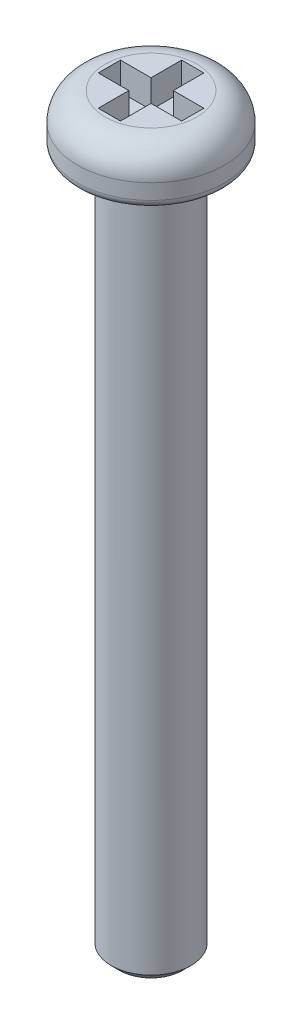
ISO-10303-21;
HEADER;
FILE_DESCRIPTION(('STEP AP214'),'2;1');
FILE_NAME('part.step','',(''),(''),'','','');
FILE_SCHEMA(('AUTOMOTIVE_DESIGN { 1 0 10303 214 1 1 1 1 }'));
ENDSEC;
DATA;
#1=APPLICATION_CONTEXT('core data for automotive mechanical design processes');
#2=APPLICATION_PROTOCOL_DEFINITION('international standard','automotive_design',2000,#1);
#3=PRODUCT_CONTEXT('',#1,'mechanical');
#4=PRODUCT('Part','Part','',(#3));
#5=PRODUCT_RELATED_PRODUCT_CATEGORY('part','',(#4));
#6=PRODUCT_DEFINITION_FORMATION('','',#4);
#7=PRODUCT_DEFINITION_CONTEXT('part definition',#1,'design');
#8=PRODUCT_DEFINITION('design','',#6,#7);
#9=PRODUCT_DEFINITION_SHAPE('','',#8);
#10=(LENGTH_UNIT() NAMED_UNIT(*) SI_UNIT(.MILLI.,.METRE.));
#11=(NAMED_UNIT(*) PLANE_ANGLE_UNIT() SI_UNIT($,.RADIAN.));
#12=(NAMED_UNIT(*) SI_UNIT($,.STERADIAN.) SOLID_ANGLE_UNIT());
#13=UNCERTAINTY_MEASURE_WITH_UNIT(LENGTH_MEASURE(1.E-05),#10,'distance_accuracy_value','');
#14=(GEOMETRIC_REPRESENTATION_CONTEXT(3) GLOBAL_UNCERTAINTY_ASSIGNED_CONTEXT((#13)) GLOBAL_UNIT_ASSIGNED_CONTEXT((#10,
#11,#12)) REPRESENTATION_CONTEXT('',''));
#15=CARTESIAN_POINT('',(0.,0.,0.));
#16=DIRECTION('',(0.,0.,1.));
#17=DIRECTION('',(1.,0.,0.));
#18=AXIS2_PLACEMENT_3D('',#15,#16,#17);
#19=CARTESIAN_POINT('',(0.,25.85,0.));
#20=DIRECTION('',(0.,1.,0.));
#21=DIRECTION('',(0.,0.,1.));
#22=AXIS2_PLACEMENT_3D('',#19,#20,#21);
#23=PLANE('',#22);
#24=DIRECTION('',(0.,0.,1.));
#25=VECTOR('',#24,1.);
#26=CARTESIAN_POINT('',(-0.4,25.85,1.5));
#27=LINE('',#26,#25);
#28=CARTESIAN_POINT('',(-0.4,25.85,0.399999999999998));
#29=VERTEX_POINT('',#28);
#30=CARTESIAN_POINT('',(-0.4,25.85,1.5));
#31=VERTEX_POINT('',#30);
#32=EDGE_CURVE('E240',#29,#31,#27,.T.);
#33=ORIENTED_EDGE('',*,*,#32,.T.);
#34=DIRECTION('',(1.,0.,0.));
#35=VECTOR('',#34,1.);
#36=CARTESIAN_POINT('',(0.4,25.85,1.5));
#37=LINE('',#36,#35);
#38=CARTESIAN_POINT('',(0.4,25.85,1.5));
#39=VERTEX_POINT('',#38);
#40=EDGE_CURVE('E246',#31,#39,#37,.T.);
#41=ORIENTED_EDGE('',*,*,#40,.T.);
#42=DIRECTION('',(0.,0.,-1.));
#43=VECTOR('',#42,1.);
#44=CARTESIAN_POINT('',(0.4,25.85,1.5));
#45=LINE('',#44,#43);
#46=CARTESIAN_POINT('',(0.4,25.85,0.400000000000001));
#47=VERTEX_POINT('',#46);
#48=EDGE_CURVE('E250',#39,#47,#45,.T.);
#49=ORIENTED_EDGE('',*,*,#48,.T.);
#50=DIRECTION('',(1.,0.,0.));
#51=VECTOR('',#50,1.);
#52=CARTESIAN_POINT('',(-1.5,25.85,0.399999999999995));
#53=LINE('',#52,#51);
#54=CARTESIAN_POINT('',(1.5,25.85,0.400000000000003));
#55=VERTEX_POINT('',#54);
#56=EDGE_CURVE('E114',#47,#55,#53,.T.);
#57=ORIENTED_EDGE('',*,*,#56,.T.);
#58=DIRECTION('',(0.,0.,-1.));
#59=VECTOR('',#58,1.);
#60=CARTESIAN_POINT('',(1.5,25.85,0.400000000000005));
#61=LINE('',#60,#59);
#62=CARTESIAN_POINT('',(1.5,25.85,-0.399999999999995));
#63=VERTEX_POINT('',#62);
#64=EDGE_CURVE('E116',#55,#63,#61,.T.);
#65=ORIENTED_EDGE('',*,*,#64,.T.);
#66=DIRECTION('',(-1.,0.,0.));
#67=VECTOR('',#66,1.);
#68=CARTESIAN_POINT('',(-1.5,25.85,-0.400000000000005));
#69=LINE('',#68,#67);
#70=CARTESIAN_POINT('',(0.4,25.85,-0.399999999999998));
#71=VERTEX_POINT('',#70);
#72=EDGE_CURVE('E120',#63,#71,#69,.T.);
#73=ORIENTED_EDGE('',*,*,#72,.T.);
#74=DIRECTION('',(0.,0.,-1.));
#75=VECTOR('',#74,1.);
#76=CARTESIAN_POINT('',(0.4,25.85,1.5));
#77=LINE('',#76,#75);
#78=CARTESIAN_POINT('',(0.4,25.85,-1.5));
#79=VERTEX_POINT('',#78);
#80=EDGE_CURVE('E208',#71,#79,#77,.T.);
#81=ORIENTED_EDGE('',*,*,#80,.T.);
#82=DIRECTION('',(-1.,0.,0.));
#83=VECTOR('',#82,1.);
#84=CARTESIAN_POINT('',(0.4,25.85,-1.5));
#85=LINE('',#84,#83);
#86=CARTESIAN_POINT('',(-0.4,25.85,-1.5));
#87=VERTEX_POINT('',#86);
#88=EDGE_CURVE('E221',#79,#87,#85,.T.);
#89=ORIENTED_EDGE('',*,*,#88,.T.);
#90=DIRECTION('',(0.,0.,1.));
#91=VECTOR('',#90,1.);
#92=CARTESIAN_POINT('',(-0.4,25.85,1.5));
#93=LINE('',#92,#91);
#94=CARTESIAN_POINT('',(-0.4,25.85,-0.400000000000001));
#95=VERTEX_POINT('',#94);
#96=EDGE_CURVE('E225',#87,#95,#93,.T.);
#97=ORIENTED_EDGE('',*,*,#96,.T.);
#98=DIRECTION('',(-1.,0.,0.));
#99=VECTOR('',#98,1.);
#100=CARTESIAN_POINT('',(-1.5,25.85,-0.400000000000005));
#101=LINE('',#100,#99);
#102=CARTESIAN_POINT('',(-1.5,25.85,-0.400000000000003));
#103=VERTEX_POINT('',#102);
#104=EDGE_CURVE('E229',#95,#103,#101,.T.);
#105=ORIENTED_EDGE('',*,*,#104,.T.);
#106=DIRECTION('',(0.,0.,1.));
#107=VECTOR('',#106,1.);
#108=CARTESIAN_POINT('',(-1.5,25.85,0.399999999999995));
#109=LINE('',#108,#107);
#110=CARTESIAN_POINT('',(-1.5,25.85,0.399999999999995));
#111=VERTEX_POINT('',#110);
#112=EDGE_CURVE('E233',#103,#111,#109,.T.);
#113=ORIENTED_EDGE('',*,*,#112,.T.);
#114=DIRECTION('',(1.,0.,0.));
#115=VECTOR('',#114,1.);
#116=CARTESIAN_POINT('',(-1.5,25.85,0.399999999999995));
#117=LINE('',#116,#115);
#118=EDGE_CURVE('E235',#111,#29,#117,.T.);
#119=ORIENTED_EDGE('',*,*,#118,.T.);
#120=EDGE_LOOP('',(#33,#41,#49,#57,#65,#73,#81,#89,#97,#105,#113,#119));
#121=FACE_BOUND('',#120,.T.);
#122=ADVANCED_FACE('F14',(#121),#23,.T.);
#123=CARTESIAN_POINT('',(-1.5,25.85,-0.400000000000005));
#124=DIRECTION('',(0.,0.,-1.));
#125=DIRECTION('',(-1.,0.,0.));
#126=AXIS2_PLACEMENT_3D('',#123,#124,#125);
#127=PLANE('',#126);
#128=DIRECTION('',(0.,1.,0.));
#129=VECTOR('',#128,1.);
#130=CARTESIAN_POINT('',(1.5,25.85,-0.399999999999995));
#131=LINE('',#130,#129);
#132=CARTESIAN_POINT('',(1.5,26.85,-0.399999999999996));
#133=VERTEX_POINT('',#132);
#134=EDGE_CURVE('E125',#63,#133,#131,.T.);
#135=ORIENTED_EDGE('',*,*,#134,.T.);
#136=DIRECTION('',(1.,0.,0.));
#137=VECTOR('',#136,1.);
#138=CARTESIAN_POINT('',(0.,26.85,-0.399999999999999));
#139=LINE('',#138,#137);
#140=CARTESIAN_POINT('',(0.4,26.85,-0.399999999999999));
#141=VERTEX_POINT('',#140);
#142=EDGE_CURVE('E215',#141,#133,#139,.T.);
#143=ORIENTED_EDGE('',*,*,#142,.F.);
#144=DIRECTION('',(0.,1.,0.));
#145=VECTOR('',#144,1.);
#146=CARTESIAN_POINT('',(0.4,25.85,-0.399999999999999));
#147=LINE('',#146,#145);
#148=EDGE_CURVE('E131',#141,#71,#147,.F.);
#149=ORIENTED_EDGE('',*,*,#148,.T.);
#150=ORIENTED_EDGE('',*,*,#72,.F.);
#151=EDGE_LOOP('',(#135,#143,#149,#150));
#152=FACE_BOUND('',#151,.T.);
#153=ADVANCED_FACE('F128',(#152),#127,.F.);
#154=CARTESIAN_POINT('',(1.5,25.85,0.400000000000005));
#155=DIRECTION('',(1.,0.,0.));
#156=DIRECTION('',(0.,0.,-1.));
#157=AXIS2_PLACEMENT_3D('',#154,#155,#156);
#158=PLANE('',#157);
#159=ORIENTED_EDGE('',*,*,#134,.F.);
#160=ORIENTED_EDGE('',*,*,#64,.F.);
#161=DIRECTION('',(0.,1.,0.));
#162=VECTOR('',#161,1.);
#163=CARTESIAN_POINT('',(1.5,25.85,0.400000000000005));
#164=LINE('',#163,#162);
#165=CARTESIAN_POINT('',(1.5,26.85,0.400000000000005));
#166=VERTEX_POINT('',#165);
#167=EDGE_CURVE('E139',#55,#166,#164,.T.);
#168=ORIENTED_EDGE('',*,*,#167,.T.);
#169=DIRECTION('',(0.,0.,1.));
#170=VECTOR('',#169,1.);
#171=CARTESIAN_POINT('',(1.5,26.85,0.));
#172=LINE('',#171,#170);
#173=EDGE_CURVE('E136',#133,#166,#172,.T.);
#174=ORIENTED_EDGE('',*,*,#173,.F.);
#175=EDGE_LOOP('',(#159,#160,#168,#174));
#176=FACE_BOUND('',#175,.T.);
#177=ADVANCED_FACE('F134',(#176),#158,.F.);
#178=CARTESIAN_POINT('',(-1.5,25.85,0.399999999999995));
#179=DIRECTION('',(0.,0.,1.));
#180=DIRECTION('',(1.,0.,0.));
#181=AXIS2_PLACEMENT_3D('',#178,#179,#180);
#182=PLANE('',#181);
#183=ORIENTED_EDGE('',*,*,#167,.F.);
#184=ORIENTED_EDGE('',*,*,#56,.F.);
#185=DIRECTION('',(0.,1.,0.));
#186=VECTOR('',#185,1.);
#187=CARTESIAN_POINT('',(0.4,25.85,0.400000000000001));
#188=LINE('',#187,#186);
#189=CARTESIAN_POINT('',(0.4,26.85,0.400000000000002));
#190=VERTEX_POINT('',#189);
#191=EDGE_CURVE('E248',#47,#190,#188,.T.);
#192=ORIENTED_EDGE('',*,*,#191,.T.);
#193=DIRECTION('',(1.,0.,0.));
#194=VECTOR('',#193,1.);
#195=CARTESIAN_POINT('',(0.,26.85,0.400000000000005));
#196=LINE('',#195,#194);
#197=EDGE_CURVE('E254',#166,#190,#196,.F.);
#198=ORIENTED_EDGE('',*,*,#197,.F.);
#199=EDGE_LOOP('',(#183,#184,#192,#198));
#200=FACE_BOUND('',#199,.T.);
#201=ADVANCED_FACE('F255',(#200),#182,.F.);
#202=CARTESIAN_POINT('',(0.4,25.85,1.5));
#203=DIRECTION('',(1.,0.,0.));
#204=DIRECTION('',(0.,0.,-1.));
#205=AXIS2_PLACEMENT_3D('',#202,#203,#204);
#206=PLANE('',#205);
#207=ORIENTED_EDGE('',*,*,#191,.F.);
#208=ORIENTED_EDGE('',*,*,#48,.F.);
#209=DIRECTION('',(0.,1.,0.));
#210=VECTOR('',#209,1.);
#211=CARTESIAN_POINT('',(0.4,25.85,1.5));
#212=LINE('',#211,#210);
#213=CARTESIAN_POINT('',(0.4,26.85,1.5));
#214=VERTEX_POINT('',#213);
#215=EDGE_CURVE('E244',#39,#214,#212,.T.);
#216=ORIENTED_EDGE('',*,*,#215,.T.);
#217=DIRECTION('',(0.,0.,1.));
#218=VECTOR('',#217,1.);
#219=CARTESIAN_POINT('',(0.4,26.85,0.));
#220=LINE('',#219,#218);
#221=EDGE_CURVE('E260',#190,#214,#220,.T.);
#222=ORIENTED_EDGE('',*,*,#221,.F.);
#223=EDGE_LOOP('',(#207,#208,#216,#222));
#224=FACE_BOUND('',#223,.T.);
#225=ADVANCED_FACE('F449',(#224),#206,.F.);
#226=CARTESIAN_POINT('',(0.4,25.85,1.5));
#227=DIRECTION('',(0.,0.,1.));
#228=DIRECTION('',(1.,0.,0.));
#229=AXIS2_PLACEMENT_3D('',#226,#227,#228);
#230=PLANE('',#229);
#231=ORIENTED_EDGE('',*,*,#215,.F.);
#232=ORIENTED_EDGE('',*,*,#40,.F.);
#233=DIRECTION('',(0.,1.,0.));
#234=VECTOR('',#233,1.);
#235=CARTESIAN_POINT('',(-0.4,25.85,1.5));
#236=LINE('',#235,#234);
#237=CARTESIAN_POINT('',(-0.4,26.85,1.5));
#238=VERTEX_POINT('',#237);
#239=EDGE_CURVE('E242',#31,#238,#236,.T.);
#240=ORIENTED_EDGE('',*,*,#239,.T.);
#241=DIRECTION('',(1.,0.,0.));
#242=VECTOR('',#241,1.);
#243=CARTESIAN_POINT('',(0.,26.85,1.5));
#244=LINE('',#243,#242);
#245=EDGE_CURVE('E267',#214,#238,#244,.F.);
#246=ORIENTED_EDGE('',*,*,#245,.F.);
#247=EDGE_LOOP('',(#231,#232,#240,#246));
#248=FACE_BOUND('',#247,.T.);
#249=ADVANCED_FACE('F439',(#248),#230,.F.);
#250=CARTESIAN_POINT('',(-0.4,25.85,1.5));
#251=DIRECTION('',(-1.,0.,0.));
#252=DIRECTION('',(0.,0.,1.));
#253=AXIS2_PLACEMENT_3D('',#250,#251,#252);
#254=PLANE('',#253);
#255=DIRECTION('',(0.,1.,0.));
#256=VECTOR('',#255,1.);
#257=CARTESIAN_POINT('',(-0.4,25.85,0.399999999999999));
#258=LINE('',#257,#256);
#259=CARTESIAN_POINT('',(-0.4,26.85,0.399999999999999));
#260=VERTEX_POINT('',#259);
#261=EDGE_CURVE('E238',#29,#260,#258,.T.);
#262=ORIENTED_EDGE('',*,*,#261,.T.);
#263=DIRECTION('',(0.,0.,1.));
#264=VECTOR('',#263,1.);
#265=CARTESIAN_POINT('',(-0.4,26.85,0.));
#266=LINE('',#265,#264);
#267=EDGE_CURVE('E270',#238,#260,#266,.F.);
#268=ORIENTED_EDGE('',*,*,#267,.F.);
#269=ORIENTED_EDGE('',*,*,#239,.F.);
#270=ORIENTED_EDGE('',*,*,#32,.F.);
#271=EDGE_LOOP('',(#262,#268,#269,#270));
#272=FACE_BOUND('',#271,.T.);
#273=ADVANCED_FACE('F429',(#272),#254,.F.);
#274=CARTESIAN_POINT('',(-1.5,25.85,0.399999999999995));
#275=DIRECTION('',(0.,0.,1.));
#276=DIRECTION('',(1.,0.,0.));
#277=AXIS2_PLACEMENT_3D('',#274,#275,#276);
#278=PLANE('',#277);
#279=DIRECTION('',(0.,1.,0.));
#280=VECTOR('',#279,1.);
#281=CARTESIAN_POINT('',(-1.5,25.85,0.399999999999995));
#282=LINE('',#281,#280);
#283=CARTESIAN_POINT('',(-1.5,26.85,0.399999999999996));
#284=VERTEX_POINT('',#283);
#285=EDGE_CURVE('E231',#111,#284,#282,.T.);
#286=ORIENTED_EDGE('',*,*,#285,.T.);
#287=DIRECTION('',(1.,0.,0.));
#288=VECTOR('',#287,1.);
#289=CARTESIAN_POINT('',(0.,26.85,0.399999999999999));
#290=LINE('',#289,#288);
#291=EDGE_CURVE('E273',#260,#284,#290,.F.);
#292=ORIENTED_EDGE('',*,*,#291,.F.);
#293=ORIENTED_EDGE('',*,*,#261,.F.);
#294=ORIENTED_EDGE('',*,*,#118,.F.);
#295=EDGE_LOOP('',(#286,#292,#293,#294));
#296=FACE_BOUND('',#295,.T.);
#297=ADVANCED_FACE('F419',(#296),#278,.F.);
#298=CARTESIAN_POINT('',(-1.5,25.85,0.399999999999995));
#299=DIRECTION('',(-1.,0.,0.));
#300=DIRECTION('',(0.,0.,1.));
#301=AXIS2_PLACEMENT_3D('',#298,#299,#300);
#302=PLANE('',#301);
#303=ORIENTED_EDGE('',*,*,#285,.F.);
#304=ORIENTED_EDGE('',*,*,#112,.F.);
#305=DIRECTION('',(0.,1.,0.));
#306=VECTOR('',#305,1.);
#307=CARTESIAN_POINT('',(-1.5,25.85,-0.400000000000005));
#308=LINE('',#307,#306);
#309=CARTESIAN_POINT('',(-1.5,26.85,-0.400000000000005));
#310=VERTEX_POINT('',#309);
#311=EDGE_CURVE('E227',#103,#310,#308,.T.);
#312=ORIENTED_EDGE('',*,*,#311,.T.);
#313=DIRECTION('',(0.,0.,1.));
#314=VECTOR('',#313,1.);
#315=CARTESIAN_POINT('',(-1.5,26.85,0.));
#316=LINE('',#315,#314);
#317=EDGE_CURVE('E276',#284,#310,#316,.F.);
#318=ORIENTED_EDGE('',*,*,#317,.F.);
#319=EDGE_LOOP('',(#303,#304,#312,#318));
#320=FACE_BOUND('',#319,.T.);
#321=ADVANCED_FACE('F409',(#320),#302,.F.);
#322=CARTESIAN_POINT('',(-1.5,25.85,-0.400000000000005));
#323=DIRECTION('',(0.,0.,-1.));
#324=DIRECTION('',(-1.,0.,0.));
#325=AXIS2_PLACEMENT_3D('',#322,#323,#324);
#326=PLANE('',#325);
#327=ORIENTED_EDGE('',*,*,#311,.F.);
#328=ORIENTED_EDGE('',*,*,#104,.F.);
#329=DIRECTION('',(0.,1.,0.));
#330=VECTOR('',#329,1.);
#331=CARTESIAN_POINT('',(-0.4,25.85,-0.400000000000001));
#332=LINE('',#331,#330);
#333=CARTESIAN_POINT('',(-0.4,26.85,-0.400000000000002));
#334=VERTEX_POINT('',#333);
#335=EDGE_CURVE('E223',#95,#334,#332,.T.);
#336=ORIENTED_EDGE('',*,*,#335,.T.);
#337=DIRECTION('',(1.,0.,0.));
#338=VECTOR('',#337,1.);
#339=CARTESIAN_POINT('',(0.,26.85,-0.400000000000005));
#340=LINE('',#339,#338);
#341=EDGE_CURVE('E279',#310,#334,#340,.T.);
#342=ORIENTED_EDGE('',*,*,#341,.F.);
#343=EDGE_LOOP('',(#327,#328,#336,#342));
#344=FACE_BOUND('',#343,.T.);
#345=ADVANCED_FACE('F399',(#344),#326,.F.);
#346=CARTESIAN_POINT('',(-0.4,25.85,1.5));
#347=DIRECTION('',(-1.,0.,0.));
#348=DIRECTION('',(0.,0.,1.));
#349=AXIS2_PLACEMENT_3D('',#346,#347,#348);
#350=PLANE('',#349);
#351=ORIENTED_EDGE('',*,*,#335,.F.);
#352=ORIENTED_EDGE('',*,*,#96,.F.);
#353=DIRECTION('',(0.,1.,0.));
#354=VECTOR('',#353,1.);
#355=CARTESIAN_POINT('',(-0.4,25.85,-1.5));
#356=LINE('',#355,#354);
#357=CARTESIAN_POINT('',(-0.4,26.85,-1.5));
#358=VERTEX_POINT('',#357);
#359=EDGE_CURVE('E219',#87,#358,#356,.T.);
#360=ORIENTED_EDGE('',*,*,#359,.T.);
#361=DIRECTION('',(0.,0.,1.));
#362=VECTOR('',#361,1.);
#363=CARTESIAN_POINT('',(-0.4,26.85,0.));
#364=LINE('',#363,#362);
#365=EDGE_CURVE('E282',#334,#358,#364,.F.);
#366=ORIENTED_EDGE('',*,*,#365,.F.);
#367=EDGE_LOOP('',(#351,#352,#360,#366));
#368=FACE_BOUND('',#367,.T.);
#369=ADVANCED_FACE('F389',(#368),#350,.F.);
#370=CARTESIAN_POINT('',(0.4,25.85,-1.5));
#371=DIRECTION('',(0.,0.,-1.));
#372=DIRECTION('',(-1.,0.,0.));
#373=AXIS2_PLACEMENT_3D('',#370,#371,#372);
#374=PLANE('',#373);
#375=ORIENTED_EDGE('',*,*,#359,.F.);
#376=ORIENTED_EDGE('',*,*,#88,.F.);
#377=DIRECTION('',(0.,1.,0.));
#378=VECTOR('',#377,1.);
#379=CARTESIAN_POINT('',(0.4,25.85,-1.5));
#380=LINE('',#379,#378);
#381=CARTESIAN_POINT('',(0.4,26.85,-1.5));
#382=VERTEX_POINT('',#381);
#383=EDGE_CURVE('E217',#79,#382,#380,.T.);
#384=ORIENTED_EDGE('',*,*,#383,.T.);
#385=DIRECTION('',(1.,0.,0.));
#386=VECTOR('',#385,1.);
#387=CARTESIAN_POINT('',(0.,26.85,-1.5));
#388=LINE('',#387,#386);
#389=EDGE_CURVE('E285',#358,#382,#388,.T.);
#390=ORIENTED_EDGE('',*,*,#389,.F.);
#391=EDGE_LOOP('',(#375,#376,#384,#390));
#392=FACE_BOUND('',#391,.T.);
#393=ADVANCED_FACE('F314',(#392),#374,.F.);
#394=CARTESIAN_POINT('',(0.4,25.85,1.5));
#395=DIRECTION('',(1.,0.,0.));
#396=DIRECTION('',(0.,0.,-1.));
#397=AXIS2_PLACEMENT_3D('',#394,#395,#396);
#398=PLANE('',#397);
#399=ORIENTED_EDGE('',*,*,#148,.F.);
#400=DIRECTION('',(0.,0.,1.));
#401=VECTOR('',#400,1.);
#402=CARTESIAN_POINT('',(0.4,26.85,0.));
#403=LINE('',#402,#401);
#404=EDGE_CURVE('E287',#382,#141,#403,.T.);
#405=ORIENTED_EDGE('',*,*,#404,.F.);
#406=ORIENTED_EDGE('',*,*,#383,.F.);
#407=ORIENTED_EDGE('',*,*,#80,.F.);
#408=EDGE_LOOP('',(#399,#405,#406,#407));
#409=FACE_BOUND('',#408,.T.);
#410=ADVANCED_FACE('F309',(#409),#398,.F.);
#411=CARTESIAN_POINT('',(0.,26.85,0.));
#412=DIRECTION('',(0.,1.,0.));
#413=DIRECTION('',(0.,0.,1.));
#414=AXIS2_PLACEMENT_3D('',#411,#412,#413);
#415=PLANE('',#414);
#416=CARTESIAN_POINT('',(0.,26.85,0.));
#417=DIRECTION('',(0.,-1.,0.));
#418=DIRECTION('',(0.,0.,-1.));
#419=AXIS2_PLACEMENT_3D('',#416,#417,#418);
#420=CIRCLE('',#419,1.65);
#421=CARTESIAN_POINT('',(0.,26.85,-1.65));
#422=VERTEX_POINT('',#421);
#423=CARTESIAN_POINT('',(0.,26.85,1.65));
#424=VERTEX_POINT('',#423);
#425=EDGE_CURVE('E289',#422,#424,#420,.T.);
#426=ORIENTED_EDGE('',*,*,#425,.F.);
#427=CARTESIAN_POINT('',(0.,26.85,0.));
#428=DIRECTION('',(0.,-1.,0.));
#429=DIRECTION('',(0.,0.,1.));
#430=AXIS2_PLACEMENT_3D('',#427,#428,#429);
#431=CIRCLE('',#430,1.65);
#432=EDGE_CURVE('E188',#424,#422,#431,.T.);
#433=ORIENTED_EDGE('',*,*,#432,.F.);
#434=EDGE_LOOP('',(#426,#433));
#435=FACE_BOUND('',#434,.T.);
#436=ORIENTED_EDGE('',*,*,#389,.T.);
#437=ORIENTED_EDGE('',*,*,#404,.T.);
#438=ORIENTED_EDGE('',*,*,#142,.T.);
#439=ORIENTED_EDGE('',*,*,#173,.T.);
#440=ORIENTED_EDGE('',*,*,#197,.T.);
#441=ORIENTED_EDGE('',*,*,#221,.T.);
#442=ORIENTED_EDGE('',*,*,#245,.T.);
#443=ORIENTED_EDGE('',*,*,#267,.T.);
#444=ORIENTED_EDGE('',*,*,#291,.T.);
#445=ORIENTED_EDGE('',*,*,#317,.T.);
#446=ORIENTED_EDGE('',*,*,#341,.T.);
#447=ORIENTED_EDGE('',*,*,#365,.T.);
#448=EDGE_LOOP('',(#436,#437,#438,#439,#440,#441,#442,#443,#444,#445,#446,#447));
#449=FACE_BOUND('',#448,.T.);
#450=ADVANCED_FACE('F196',(#435,#449),#415,.T.);
#451=CARTESIAN_POINT('',(0.,25.85,0.));
#452=DIRECTION('',(0.,1.,0.));
#453=DIRECTION('',(0.,0.,1.));
#454=AXIS2_PLACEMENT_3D('',#451,#452,#453);
#455=TOROIDAL_SURFACE('',#454,1.65,1.);
#456=CARTESIAN_POINT('',(0.,25.85,0.));
#457=DIRECTION('',(0.,-1.,0.));
#458=DIRECTION('',(0.,0.,-1.));
#459=AXIS2_PLACEMENT_3D('',#456,#457,#458);
#460=CIRCLE('',#459,2.65);
#461=CARTESIAN_POINT('',(0.,25.85,-2.65));
#462=VERTEX_POINT('',#461);
#463=EDGE_CURVE('E185',#462,#462,#460,.T.);
#464=ORIENTED_EDGE('',*,*,#463,.F.);
#465=EDGE_LOOP('',(#464));
#466=FACE_BOUND('',#465,.T.);
#467=ORIENTED_EDGE('',*,*,#432,.T.);
#468=ORIENTED_EDGE('',*,*,#425,.T.);
#469=EDGE_LOOP('',(#467,#468));
#470=FACE_BOUND('',#469,.T.);
#471=ADVANCED_FACE('F192',(#466,#470),#455,.T.);
#472=CARTESIAN_POINT('',(0.,26.85,0.));
#473=DIRECTION('',(0.,-1.,0.));
#474=DIRECTION('',(0.,0.,-1.));
#475=AXIS2_PLACEMENT_3D('',#472,#473,#474);
#476=CYLINDRICAL_SURFACE('',#475,2.65);
#477=ORIENTED_EDGE('',*,*,#463,.T.);
#478=EDGE_LOOP('',(#477));
#479=FACE_BOUND('',#478,.T.);
#480=CARTESIAN_POINT('',(0.,25.3,0.));
#481=DIRECTION('',(0.,1.,0.));
#482=DIRECTION('',(0.,0.,1.));
#483=AXIS2_PLACEMENT_3D('',#480,#481,#482);
#484=CIRCLE('',#483,2.65);
#485=CARTESIAN_POINT('',(0.,25.3,2.65));
#486=VERTEX_POINT('',#485);
#487=EDGE_CURVE('E177',#486,#486,#484,.F.);
#488=ORIENTED_EDGE('',*,*,#487,.F.);
#489=EDGE_LOOP('',(#488));
#490=FACE_BOUND('',#489,.T.);
#491=ADVANCED_FACE('F164',(#479,#490),#476,.T.);
#492=CARTESIAN_POINT('',(0.,25.3,0.));
#493=DIRECTION('',(0.,1.,0.));
#494=DIRECTION('',(0.,0.,1.));
#495=AXIS2_PLACEMENT_3D('',#492,#493,#494);
#496=TOROIDAL_SURFACE('',#495,2.35,0.3);
#497=CARTESIAN_POINT('',(0.,25.,0.));
#498=DIRECTION('',(0.,1.,0.));
#499=DIRECTION('',(0.,0.,1.));
#500=AXIS2_PLACEMENT_3D('',#497,#498,#499);
#501=CIRCLE('',#500,2.35);
#502=CARTESIAN_POINT('',(0.,25.,2.35));
#503=VERTEX_POINT('',#502);
#504=CARTESIAN_POINT('',(0.,25.,-2.35));
#505=VERTEX_POINT('',#504);
#506=EDGE_CURVE('E33',#503,#505,#501,.T.);
#507=ORIENTED_EDGE('',*,*,#506,.T.);
#508=CARTESIAN_POINT('',(0.,25.,0.));
#509=DIRECTION('',(0.,1.,0.));
#510=DIRECTION('',(0.,0.,-1.));
#511=AXIS2_PLACEMENT_3D('',#508,#509,#510);
#512=CIRCLE('',#511,2.35);
#513=EDGE_CURVE('E147',#505,#503,#512,.T.);
#514=ORIENTED_EDGE('',*,*,#513,.T.);
#515=EDGE_LOOP('',(#507,#514));
#516=FACE_BOUND('',#515,.T.);
#517=ORIENTED_EDGE('',*,*,#487,.T.);
#518=EDGE_LOOP('',(#517));
#519=FACE_BOUND('',#518,.T.);
#520=ADVANCED_FACE('F152',(#516,#519),#496,.T.);
#521=CARTESIAN_POINT('',(0.,0.,0.));
#522=DIRECTION('',(0.,1.,0.));
#523=DIRECTION('',(0.,0.,1.));
#524=AXIS2_PLACEMENT_3D('',#521,#522,#523);
#525=PLANE('',#524);
#526=CARTESIAN_POINT('',(0.,0.,0.));
#527=DIRECTION('',(0.,1.,0.));
#528=DIRECTION('',(0.,0.,1.));
#529=AXIS2_PLACEMENT_3D('',#526,#527,#528);
#530=CIRCLE('',#529,1.1299999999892);
#531=CARTESIAN_POINT('',(0.,0.,1.1299999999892));
#532=VERTEX_POINT('',#531);
#533=EDGE_CURVE('E145',#532,#532,#530,.T.);
#534=ORIENTED_EDGE('',*,*,#533,.F.);
#535=EDGE_LOOP('',(#534));
#536=FACE_BOUND('',#535,.T.);
#537=ADVANCED_FACE('F163',(#536),#525,.F.);
#538=CARTESIAN_POINT('',(0.,25.,0.));
#539=DIRECTION('',(0.,1.,0.));
#540=DIRECTION('',(0.,0.,1.));
#541=AXIS2_PLACEMENT_3D('',#538,#539,#540);
#542=PLANE('',#541);
#543=CARTESIAN_POINT('',(0.,25.,0.));
#544=DIRECTION('',(0.,-1.,0.));
#545=DIRECTION('',(0.,0.,-1.));
#546=AXIS2_PLACEMENT_3D('',#543,#544,#545);
#547=CIRCLE('',#546,1.43);
#548=CARTESIAN_POINT('',(0.,25.,-1.43));
#549=VERTEX_POINT('',#548);
#550=EDGE_CURVE('E25',#549,#549,#547,.T.);
#551=ORIENTED_EDGE('',*,*,#550,.F.);
#552=EDGE_LOOP('',(#551));
#553=FACE_BOUND('',#552,.T.);
#554=ORIENTED_EDGE('',*,*,#506,.F.);
#555=ORIENTED_EDGE('',*,*,#513,.F.);
#556=EDGE_LOOP('',(#554,#555));
#557=FACE_BOUND('',#556,.T.);
#558=ADVANCED_FACE('F324',(#553,#557),#542,.F.);
#559=CARTESIAN_POINT('',(0.,0.299999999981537,0.));
#560=DIRECTION('',(0.,1.,0.));
#561=DIRECTION('',(0.,0.,1.));
#562=AXIS2_PLACEMENT_3D('',#559,#560,#561);
#563=CONICAL_SURFACE('',#562,1.42999999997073,0.785398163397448);
#564=CARTESIAN_POINT('',(0.,0.300000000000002,0.));
#565=DIRECTION('',(0.,-1.,0.));
#566=DIRECTION('',(0.,0.,-1.));
#567=AXIS2_PLACEMENT_3D('',#564,#565,#566);
#568=CIRCLE('',#567,1.43);
#569=CARTESIAN_POINT('',(0.,0.300000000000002,-1.43));
#570=VERTEX_POINT('',#569);
#571=EDGE_CURVE('E9',#570,#570,#568,.F.);
#572=ORIENTED_EDGE('',*,*,#571,.F.);
#573=EDGE_LOOP('',(#572));
#574=FACE_BOUND('',#573,.T.);
#575=ORIENTED_EDGE('',*,*,#533,.T.);
#576=EDGE_LOOP('',(#575));
#577=FACE_BOUND('',#576,.T.);
#578=ADVANCED_FACE('F318',(#574,#577),#563,.T.);
#579=CARTESIAN_POINT('',(0.,25.,0.));
#580=DIRECTION('',(0.,-1.,0.));
#581=DIRECTION('',(0.,0.,-1.));
#582=AXIS2_PLACEMENT_3D('',#579,#580,#581);
#583=CYLINDRICAL_SURFACE('',#582,1.43);
#584=ORIENTED_EDGE('',*,*,#571,.T.);
#585=EDGE_LOOP('',(#584));
#586=FACE_BOUND('',#585,.T.);
#587=ORIENTED_EDGE('',*,*,#550,.T.);
#588=EDGE_LOOP('',(#587));
#589=FACE_BOUND('',#588,.T.);
#590=ADVANCED_FACE('F316',(#586,#589),#583,.T.);
#591=CLOSED_SHELL('',(#122,#153,#177,#201,#225,#249,#273,#297,#321,#345,#369,#393,#410,#450,
#471,#491,#520,#537,#558,#578,#590));
#592=MANIFOLD_SOLID_BREP('B1',#591);
#593=ADVANCED_BREP_SHAPE_REPRESENTATION('',(#18,#592),#14);
#594=SHAPE_DEFINITION_REPRESENTATION(#9,#593);
ENDSEC;
END-ISO-10303-21;
